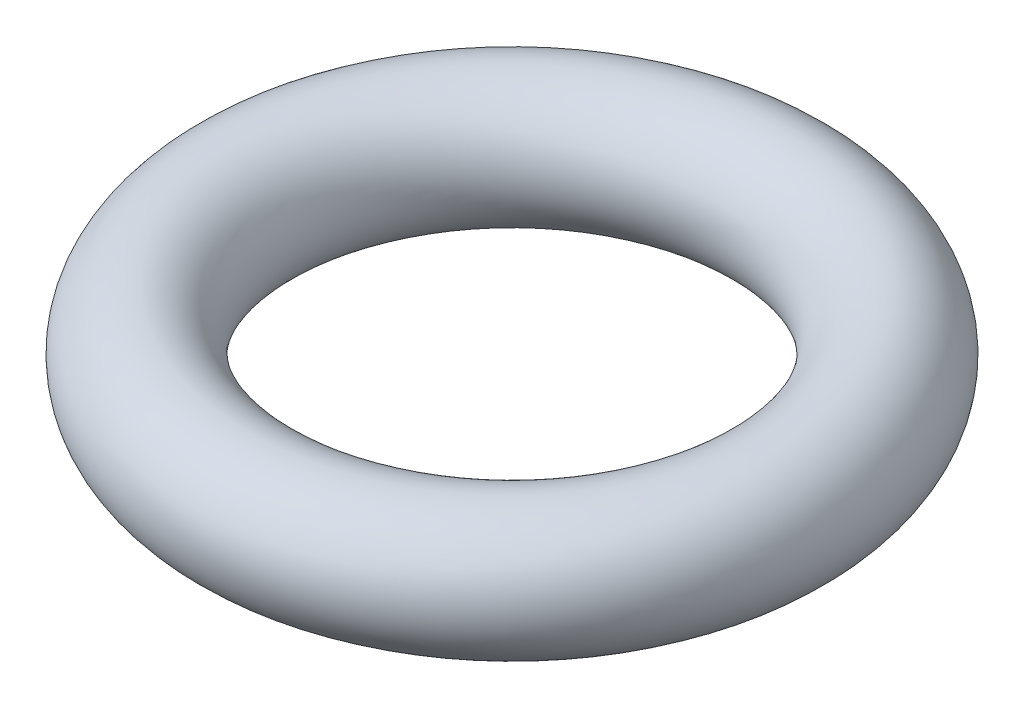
ISO-10303-21;
HEADER;
FILE_DESCRIPTION(('STEP AP214'),'2;1');
FILE_NAME('part.step','',(''),(''),'','','');
FILE_SCHEMA(('AUTOMOTIVE_DESIGN { 1 0 10303 214 1 1 1 1 }'));
ENDSEC;
DATA;
#1=APPLICATION_CONTEXT('core data for automotive mechanical design processes');
#2=APPLICATION_PROTOCOL_DEFINITION('international standard','automotive_design',2000,#1);
#3=PRODUCT_CONTEXT('',#1,'mechanical');
#4=PRODUCT('Part','Part','',(#3));
#5=PRODUCT_RELATED_PRODUCT_CATEGORY('part','',(#4));
#6=PRODUCT_DEFINITION_FORMATION('','',#4);
#7=PRODUCT_DEFINITION_CONTEXT('part definition',#1,'design');
#8=PRODUCT_DEFINITION('design','',#6,#7);
#9=PRODUCT_DEFINITION_SHAPE('','',#8);
#10=(LENGTH_UNIT() NAMED_UNIT(*) SI_UNIT(.MILLI.,.METRE.));
#11=(NAMED_UNIT(*) PLANE_ANGLE_UNIT() SI_UNIT($,.RADIAN.));
#12=(NAMED_UNIT(*) SI_UNIT($,.STERADIAN.) SOLID_ANGLE_UNIT());
#13=UNCERTAINTY_MEASURE_WITH_UNIT(LENGTH_MEASURE(1.E-05),#10,'distance_accuracy_value','');
#14=(GEOMETRIC_REPRESENTATION_CONTEXT(3) GLOBAL_UNCERTAINTY_ASSIGNED_CONTEXT((#13)) GLOBAL_UNIT_ASSIGNED_CONTEXT((#10,
#11,#12)) REPRESENTATION_CONTEXT('',''));
#15=CARTESIAN_POINT('',(0.,0.,0.));
#16=DIRECTION('',(0.,0.,1.));
#17=DIRECTION('',(1.,0.,0.));
#18=AXIS2_PLACEMENT_3D('',#15,#16,#17);
#19=CARTESIAN_POINT('',(0.,0.,0.));
#20=DIRECTION('',(0.,-1.,0.));
#21=DIRECTION('',(0.,0.,-1.));
#22=AXIS2_PLACEMENT_3D('',#19,#20,#21);
#23=TOROIDAL_SURFACE('',#22,3.525,0.85);
#24=CARTESIAN_POINT('',(0.,0.,-4.375));
#25=VERTEX_POINT('',#24);
#26=VERTEX_LOOP('',#25);
#27=FACE_BOUND('',#26,.T.);
#28=ADVANCED_FACE('F27',(#27),#23,.T.);
#29=CLOSED_SHELL('',(#28));
#30=MANIFOLD_SOLID_BREP('B2',#29);
#31=ADVANCED_BREP_SHAPE_REPRESENTATION('',(#18,#30),#14);
#32=SHAPE_DEFINITION_REPRESENTATION(#9,#31);
ENDSEC;
END-ISO-10303-21;
